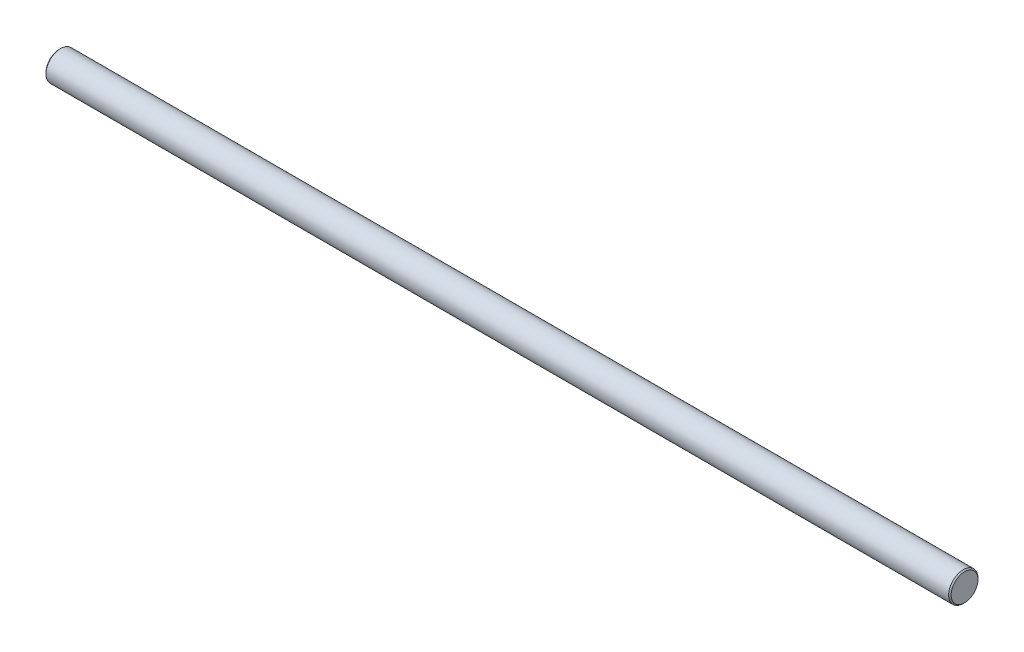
from build123d import *

# Parameters (mm, degrees)
SKETCH_1_R      = 3
EXTRUDE_1_DEPTH = 185
CHAMFER_1_SIZE  = 0.25


with BuildPart() as part:
    # Sketch 1 → Extrude 1 (new body)
    with BuildSketch(Plane(origin=(0, 0, 0), x_dir=(0, 0, -1), z_dir=(1, 0, 0))):
        Circle(SKETCH_1_R)
    extrude(amount=EXTRUDE_1_DEPTH)

    # Chamfer 1
    chamfer_1_edges = [part.edges().sort_by_distance(p)[0] for p in [
        (0, 0, 3),
        (185, 0, 3),
    ]]
    chamfer(chamfer_1_edges, length=CHAMFER_1_SIZE)


solid = part.part
